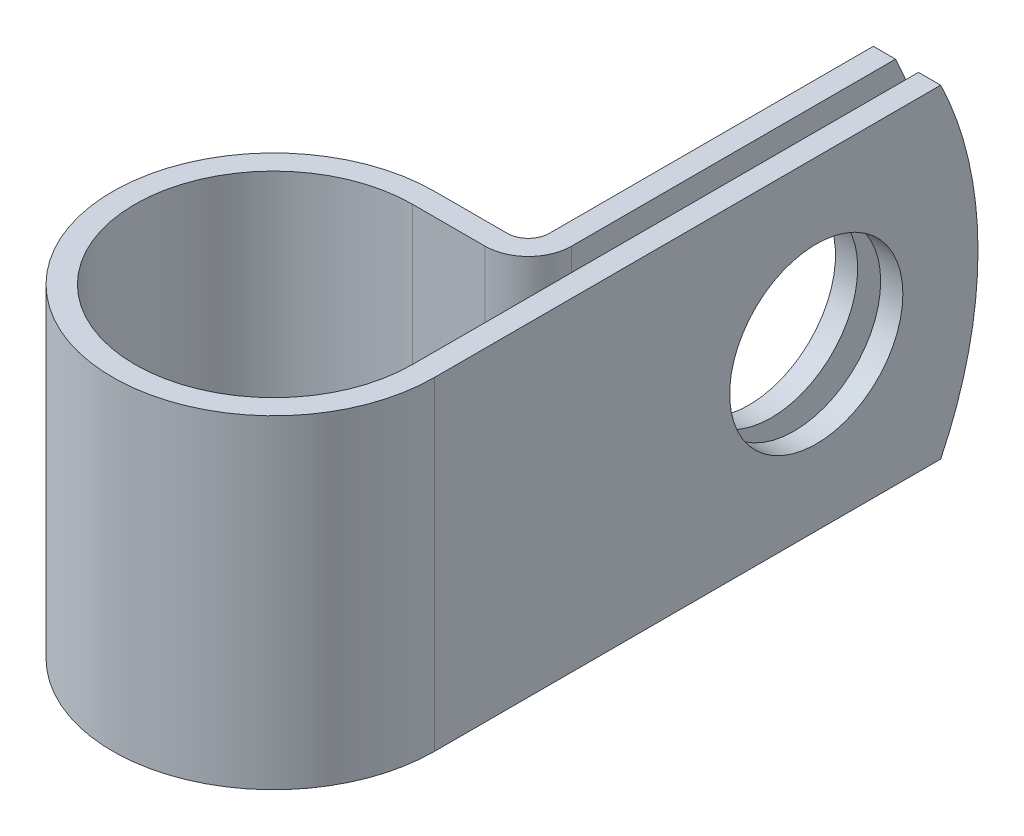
from build123d import *

# Parameters (mm, degrees)
EXTRUDE_THIN1_DEPTH = 11.1125
SKETCH2_R           = 5.9436
CUT_EXTRUDE1_DEPTH  = 1.524
CUT_EXTRUDE2_REACH  = 46.745
SKETCH3_R           = 5.9436
CUT_EXTRUDE3_DEPTH  = 43.652145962


with BuildPart() as part:
    # Sketch1 → Extrude-Thin1 (new, symmetric)
    with BuildSketch(Plane(origin=(0, 0, 0), x_dir=(1, 0, 0), z_dir=(0, 1, 0))):
        with BuildLine():
            Line((9.525, 37.2872), (9.525, 9.525))
            Line((9.525, 9.525), (9.525, 0))
            ThreePointArc((9.525, 0), (-6.735192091, -6.735192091), (0, 9.525))
            Line((0, 9.525), (4.9784, 9.525))
            ThreePointArc((4.9784, 9.525), (7.079779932, 10.395420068), (7.9502, 12.4968))
            Line((7.9502, 12.4968), (7.9502, 37.2872))
            Line((7.9502, 37.2872), (6.4262, 37.2872))
            Line((6.4262, 37.2872), (6.4262, 12.4968))
            ThreePointArc((6.4262, 12.4968), (6.002149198, 11.473050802), (4.9784, 11.049))
            Line((4.9784, 11.049), (0, 11.049))
            ThreePointArc((0, 11.049), (-7.812822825, -7.812822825), (11.049, 0))
            Line((11.049, 0), (11.049, 9.525))
            Line((11.049, 9.525), (11.049, 37.2872))
            Line((11.049, 37.2872), (9.525, 37.2872))
        make_face()
    extrude(amount=EXTRUDE_THIN1_DEPTH, both=True)

    # Sketch2 → Cut-Extrude1 (cut)
    with BuildSketch(Plane.ZY.offset(-6.4262)):
        with Locations((-26.1874, 0)):
            Circle(SKETCH2_R)
    extrude(amount=-CUT_EXTRUDE1_DEPTH, mode=Mode.SUBTRACT)

    # Sketch3 → Cut-Extrude2 (cut, up to next)
    with BuildSketch(Plane(origin=(11.049, 0, 0), x_dir=(0, 0, -1), z_dir=(1, 0, 0)), mode=Mode.PRIVATE) as cut_extrude2_sk1:
        with Locations(Location((26.1874, 0, 0), (0, 0, 180))):
            Circle(SKETCH3_R)
    cut_extrude2_tool1 = extrude(cut_extrude2_sk1.sketch, amount=-CUT_EXTRUDE2_REACH, mode=Mode.PRIVATE) & part.part
    add(cut_extrude2_tool1.solids().sort_by_distance((11.049, 0, -26.1874))[0], mode=Mode.SUBTRACT)

    # Sketch4 → Cut-Extrude3 (cut, through all)
    with BuildSketch(Plane.ZY.offset(-6.4262)):
        with BuildLine():
            Line((-34.72734763, 11.1125), (-37.2872, 11.1125))
            Line((-37.2872, 11.1125), (-37.2872, 0))
            ThreePointArc((-37.2872, 0), (-36.638965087, 5.701765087), (-34.72734763, 11.1125))
        make_face()
        with BuildLine():
            ThreePointArc((-34.72734763, -11.1125), (-36.638965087, -5.701765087), (-37.2872, 0))
            Line((-37.2872, 0), (-37.2872, -11.1125))
            Line((-37.2872, -11.1125), (-34.72734763, -11.1125))
        make_face()
    extrude(amount=-CUT_EXTRUDE3_DEPTH, mode=Mode.SUBTRACT)


solid = part.part
